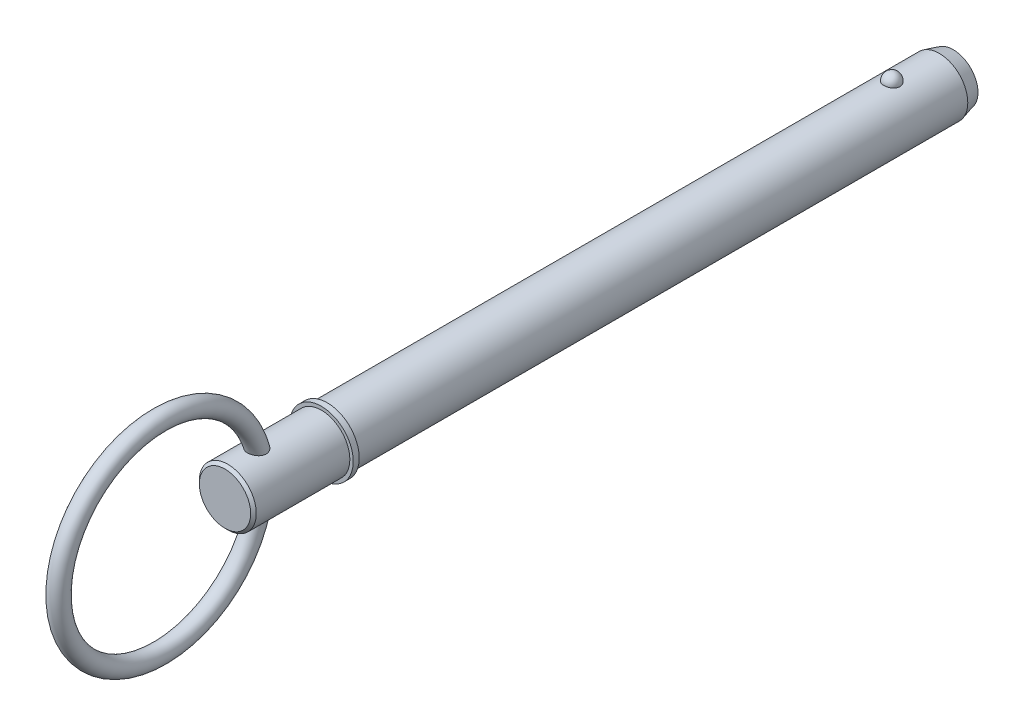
from build123d import *

# Parameters (mm, degrees)
SKETCH2_R           = 7.145
BOSS_EXTRUDE1_DEPTH = 139.7
BOSS_EXTRUDE2_START = 17.45
SKETCH3_R           = 7.145
BOSS_EXTRUDE2_DEPTH = 17.45
CHAMFER1_SIZE       = 3.5
CHAMFER1_SIZE2      = 0.937822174
SKETCH20_W          = 1.5
SKETCH20_H          = 8
SKETCH21_R          = 7.145
BOSS_EXTRUDE3_DEPTH = 25.7
CHAMFER2_SIZE       = 0.7
SKETCH24_R          = 2.25


with BuildPart() as part:
    # Sketch2 → Boss-Extrude1 (new body)
    with BuildSketch(Plane.XY):
        Circle(SKETCH2_R)
    extrude(amount=BOSS_EXTRUDE1_DEPTH)

    # Sketch3 → Boss-Extrude2 (add)
    with BuildSketch(Plane(origin=(0, 0, 0), x_dir=(-1, 0, 0), z_dir=(0, 0, -1)).offset(BOSS_EXTRUDE2_START)):
        Circle(SKETCH3_R)
    extrude(amount=-BOSS_EXTRUDE2_DEPTH)

    # Chamfer1
    chamfer1_edges = [part.edges().sort_by_distance(p)[0] for p in [
        (7.145, 0, -17.45),
    ]]
    chamfer1_side = [part.faces().sort_by_distance(p)[0] for p in [
        (7.145, 0, -8.725),
    ]]
    chamfer(chamfer1_edges, length=CHAMFER1_SIZE, length2=CHAMFER1_SIZE2, reference=chamfer1_side[0])

    # Sketch18 → Revolve1 (revolve)
    with BuildSketch(Plane(origin=(0, 0, 0), x_dir=(0, 0, -1), z_dir=(1, 0, 0))):
        with BuildLine():
            Line((2.02, 9.165), (2.02, 5.125))
            ThreePointArc((2.02, 5.125), (0, 7.145), (2.02, 9.165))
        make_face()
    revolve(axis=Axis((0, 9.165, -2.02), (0, -1, 0)))

    # Sketch20 → Revolve2 (revolve)
    with BuildSketch(Plane(origin=(0, 0, 0), x_dir=(0, 0, -1), z_dir=(1, 0, 0)), mode=Mode.PRIVATE) as revolve2_sk:
        with Locations((-140.45, 4)):
            Rectangle(SKETCH20_W, SKETCH20_H)
    revolve(revolve2_sk.sketch.rotate(Axis((0, 0, 33.728787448), (0, 0, 1)), 270), axis=Axis((0, 0, 33.728787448), (0, 0, 1)))

    # Sketch21 → Boss-Extrude3 (add)
    with BuildSketch(Plane(origin=(0, 0, 139.7), x_dir=(-1, 0, 0), z_dir=(0, 0, -1))):
        with Locations(Location((0, 0, 0), (0, 0, 180))):
            Circle(SKETCH21_R)
    extrude(amount=-BOSS_EXTRUDE3_DEPTH)

    # Chamfer2
    chamfer2_edges = [part.edges().sort_by_distance(p)[0] for p in [
        (-7.145, 0, 165.4),
    ]]
    chamfer(chamfer2_edges, length=CHAMFER2_SIZE)

    # Sweep1: sweep along a path in Sketch23
    with BuildLine(Plane(origin=(0, 0, 0), x_dir=(0, 0, -1), z_dir=(1, 0, 0))) as sweep1_path:
        CenterArc((-181.8, 0), 25.4, 0, 360)
    # Sketch24 → Sweep1 (sweep)
    with BuildSketch(Plane(origin=(0, 0, 0), x_dir=(1, 0, 0), z_dir=(0, 1, 0))):
        with Locations((0, -156.4)):
            Circle(SKETCH24_R)
    sweep(path=sweep1_path.line)


solid = part.part
